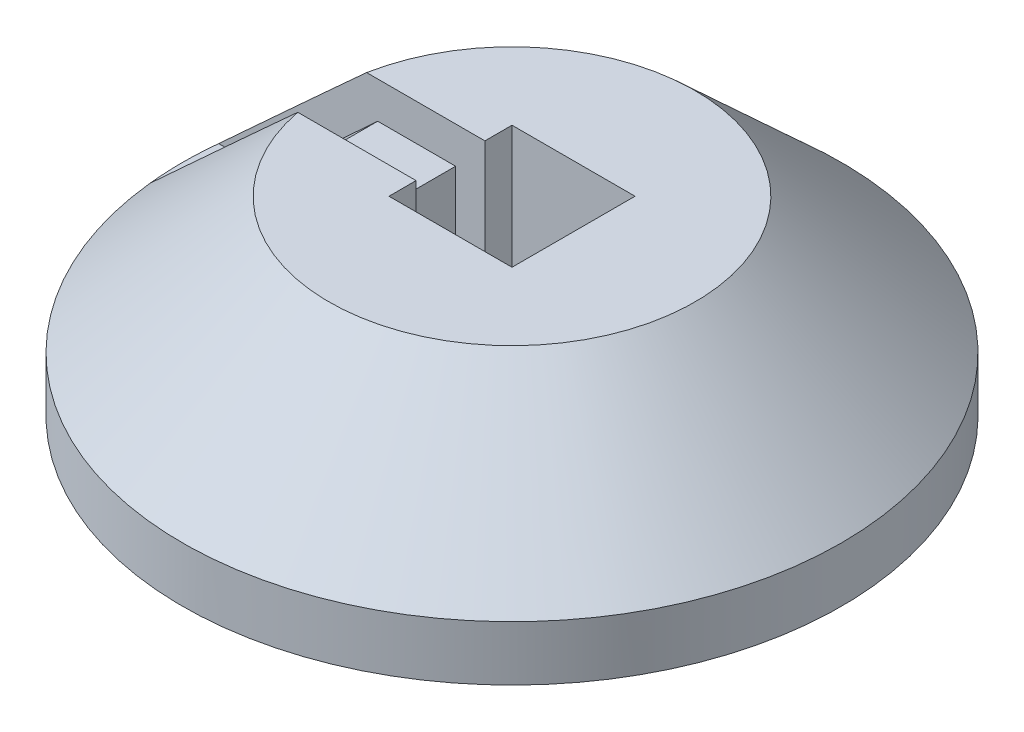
from build123d import *

# Parameters (mm, degrees)
SKETCH2_W          = 42.672
SKETCH2_H          = 42.672
SKETCH2_W_2        = 10.16
SKETCH2_H_2        = 23.876
CUT_EXTRUDE1_DEPTH = 59.944
CUT_EXTRUDE2_DEPTH = 11.938


with BuildPart() as part:
    # Sketch1 → Revolve1 (revolve)
    with BuildSketch(Plane.XY):
        Polygon((0, 66.04), (-63.5, 66.04), (-114.3, 19.05), (-114.3, 0), (-63.5, 0), (0, 0), align=None)
    revolve(axis=Axis((0, 66.04, 0), (0, -1, 0)))

    # Sketch2 → Cut-Extrude1 (cut)
    with BuildSketch(Plane(origin=(0, 66.04, 0), x_dir=(1, 0, 0), z_dir=(0, 1, 0))):
        Rectangle(SKETCH2_W, SKETCH2_H)
        with Locations((-26.416, 0)):
            Rectangle(SKETCH2_W_2, SKETCH2_H_2)
    extrude(amount=-CUT_EXTRUDE1_DEPTH, mode=Mode.SUBTRACT)

    # Sketch3 → Cut-Extrude2 (cut, symmetric)
    with BuildSketch(Plane.XY):
        Polygon((-26.416, 66.04), (-63.5, 66.04), (-114.3, 19.05), (-95.597179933, 19.05), (-58.526909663, 53.34), (-26.416, 53.34), align=None)
    extrude(amount=CUT_EXTRUDE2_DEPTH, both=True, mode=Mode.SUBTRACT)


solid = part.part
